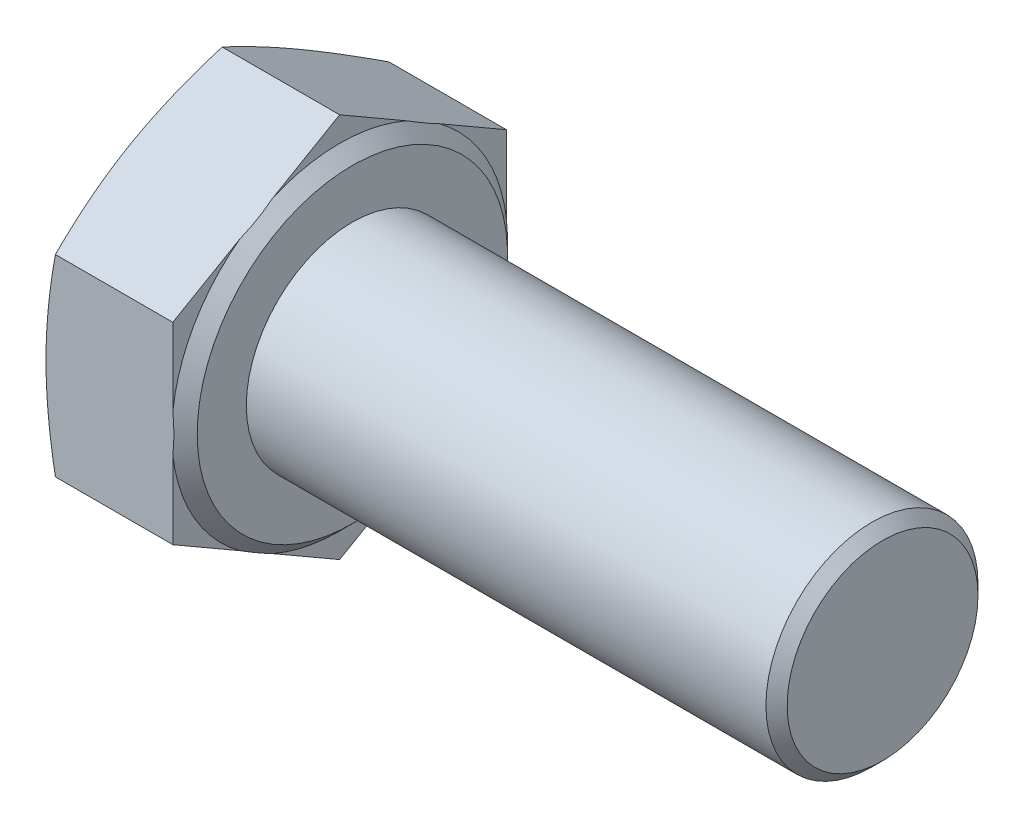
from build123d import *

# Parameters (mm, degrees)
BASEHEAD_DEPTH = 6.58
SKETCH5_R      = 5
BASEBODY_DEPTH = 25
CHAMFER1_SIZE  = 0.5


with BuildPart() as part:
    # Sketch2 → BaseHead (new body)
    with BuildSketch(Plane(origin=(0, 0, 0), x_dir=(0, 0, -1), z_dir=(1, 0, 0))):
        Polygon((7.865, -4.540859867), (7.865, 4.540859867), (0, 9.081719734), (-7.865, 4.540859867), (-7.865, -4.540859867), (0, -9.081719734), align=None)
    extrude(amount=BASEHEAD_DEPTH)

    # Sketch3 → BearingFace (revolve, cut)
    with BuildSketch(Plane.XY, mode=Mode.PRIVATE) as bearingface_sk:
        Polygon((6.58, 9.081719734), (6.58, 7.315), (5.98, 7.915), (5.98, 9.081719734), align=None)
    revolve(bearingface_sk.sketch.rotate(Axis((-0.957090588, 0, 0), (1, 0, 0)), 90), axis=Axis((-0.957090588, 0, 0), (1, 0, 0)), mode=Mode.SUBTRACT)

    # Sketch4 → HeadChamfer (revolve, cut)
    with BuildSketch(Plane.XY):
        Polygon((0, 9.081719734), (0.442849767, 9.081719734), (0, 7.865), align=None)
    revolve(axis=Axis((-0.493528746, 0, 0), (1, 0, 0)), mode=Mode.SUBTRACT)

    # Sketch5 → BaseBody (add)
    with BuildSketch(Plane(origin=(6.58, 0, 0), x_dir=(0, 0, -1), z_dir=(1, 0, 0))):
        with Locations(Location((0, 0, 0), (0, 0, 180))):
            Circle(SKETCH5_R)
    extrude(amount=BASEBODY_DEPTH)

    # Chamfer1
    chamfer1_edges = [part.edges().sort_by_distance(p)[0] for p in [
        (31.58, 0, -5),
    ]]
    chamfer(chamfer1_edges, length=CHAMFER1_SIZE)


solid = part.part
